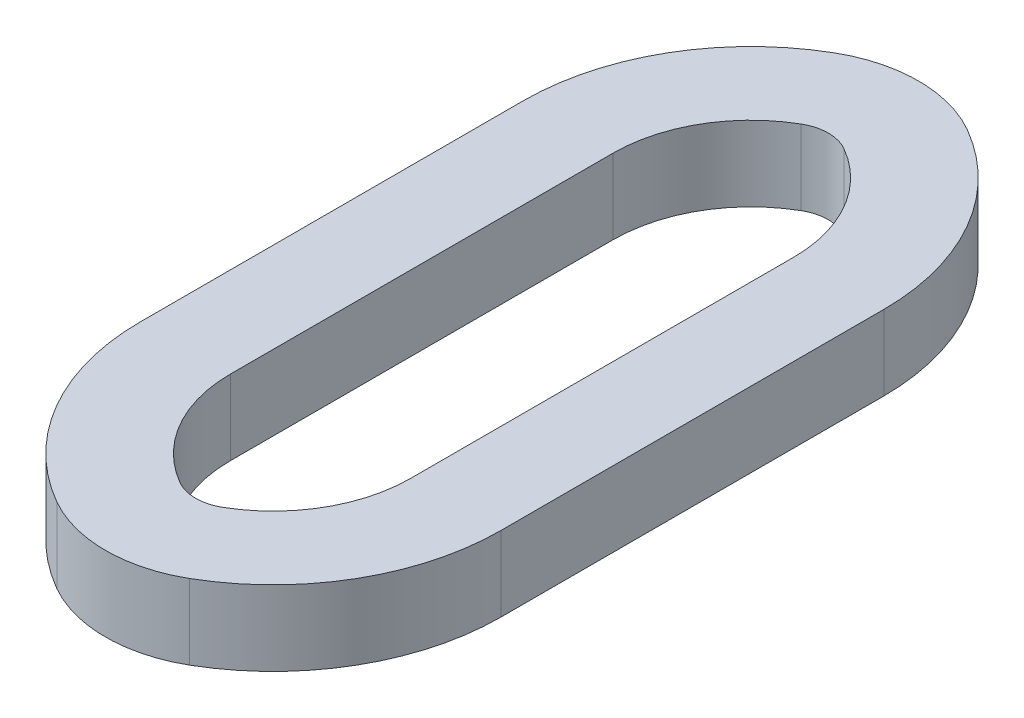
ISO-10303-21;
HEADER;
FILE_DESCRIPTION(('STEP AP214'),'2;1');
FILE_NAME('part.step','',(''),(''),'','','');
FILE_SCHEMA(('AUTOMOTIVE_DESIGN { 1 0 10303 214 1 1 1 1 }'));
ENDSEC;
DATA;
#1=APPLICATION_CONTEXT('core data for automotive mechanical design processes');
#2=APPLICATION_PROTOCOL_DEFINITION('international standard','automotive_design',2000,#1);
#3=PRODUCT_CONTEXT('',#1,'mechanical');
#4=PRODUCT('Part','Part','',(#3));
#5=PRODUCT_RELATED_PRODUCT_CATEGORY('part','',(#4));
#6=PRODUCT_DEFINITION_FORMATION('','',#4);
#7=PRODUCT_DEFINITION_CONTEXT('part definition',#1,'design');
#8=PRODUCT_DEFINITION('design','',#6,#7);
#9=PRODUCT_DEFINITION_SHAPE('','',#8);
#10=(LENGTH_UNIT() NAMED_UNIT(*) SI_UNIT(.MILLI.,.METRE.));
#11=(NAMED_UNIT(*) PLANE_ANGLE_UNIT() SI_UNIT($,.RADIAN.));
#12=(NAMED_UNIT(*) SI_UNIT($,.STERADIAN.) SOLID_ANGLE_UNIT());
#13=UNCERTAINTY_MEASURE_WITH_UNIT(LENGTH_MEASURE(1.E-05),#10,'distance_accuracy_value','');
#14=(GEOMETRIC_REPRESENTATION_CONTEXT(3) GLOBAL_UNCERTAINTY_ASSIGNED_CONTEXT((#13)) GLOBAL_UNIT_ASSIGNED_CONTEXT((#10,
#11,#12)) REPRESENTATION_CONTEXT('',''));
#15=CARTESIAN_POINT('',(0.,0.,0.));
#16=DIRECTION('',(0.,0.,1.));
#17=DIRECTION('',(1.,0.,0.));
#18=AXIS2_PLACEMENT_3D('',#15,#16,#17);
#19=CARTESIAN_POINT('',(-42.7,7.49,-4.09397459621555));
#20=DIRECTION('',(0.,1.,0.));
#21=DIRECTION('',(0.,0.,1.));
#22=AXIS2_PLACEMENT_3D('',#19,#20,#21);
#23=PLANE('',#22);
#24=CARTESIAN_POINT('',(-42.7,7.49,-4.09397459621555));
#25=DIRECTION('',(0.,1.,0.));
#26=DIRECTION('',(0.,0.,1.));
#27=AXIS2_PLACEMENT_3D('',#24,#25,#26);
#28=CIRCLE('',#27,2.40000000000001);
#29=CARTESIAN_POINT('',(-40.3,7.49,-4.09397459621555));
#30=VERTEX_POINT('',#29);
#31=CARTESIAN_POINT('',(-41.5,7.49,-6.17243556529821));
#32=VERTEX_POINT('',#31);
#33=EDGE_CURVE('E219',#30,#32,#28,.T.);
#34=ORIENTED_EDGE('',*,*,#33,.T.);
#35=CARTESIAN_POINT('',(-42.2,7.49,-4.96));
#36=DIRECTION('',(0.,1.,0.));
#37=DIRECTION('',(0.,0.,1.));
#38=AXIS2_PLACEMENT_3D('',#35,#36,#37);
#39=CIRCLE('',#38,1.4);
#40=CARTESIAN_POINT('',(-42.9,7.49,-6.17243556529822));
#41=VERTEX_POINT('',#40);
#42=EDGE_CURVE('E222',#32,#41,#39,.T.);
#43=ORIENTED_EDGE('',*,*,#42,.T.);
#44=CARTESIAN_POINT('',(-41.7,7.49,-4.09397459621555));
#45=DIRECTION('',(0.,1.,0.));
#46=DIRECTION('',(0.,0.,1.));
#47=AXIS2_PLACEMENT_3D('',#44,#45,#46);
#48=CIRCLE('',#47,2.40000000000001);
#49=CARTESIAN_POINT('',(-44.1,7.49,-4.09397459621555));
#50=VERTEX_POINT('',#49);
#51=EDGE_CURVE('E225',#41,#50,#48,.T.);
#52=ORIENTED_EDGE('',*,*,#51,.T.);
#53=DIRECTION('',(0.,0.,1.));
#54=VECTOR('',#53,1.);
#55=CARTESIAN_POINT('',(-44.1,7.49,-4.09397459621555));
#56=LINE('',#55,#54);
#57=CARTESIAN_POINT('',(-44.1,7.49,-0.0660254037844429));
#58=VERTEX_POINT('',#57);
#59=EDGE_CURVE('E227',#50,#58,#56,.T.);
#60=ORIENTED_EDGE('',*,*,#59,.T.);
#61=CARTESIAN_POINT('',(-41.7,7.49,-0.0660254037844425));
#62=DIRECTION('',(0.,1.,0.));
#63=DIRECTION('',(0.,0.,1.));
#64=AXIS2_PLACEMENT_3D('',#61,#62,#63);
#65=CIRCLE('',#64,2.40000000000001);
#66=CARTESIAN_POINT('',(-42.9,7.49,2.01243556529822));
#67=VERTEX_POINT('',#66);
#68=EDGE_CURVE('E229',#58,#67,#65,.T.);
#69=ORIENTED_EDGE('',*,*,#68,.T.);
#70=CARTESIAN_POINT('',(-42.2,7.49,0.800000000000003));
#71=DIRECTION('',(0.,1.,0.));
#72=DIRECTION('',(0.,0.,1.));
#73=AXIS2_PLACEMENT_3D('',#70,#71,#72);
#74=CIRCLE('',#73,1.4);
#75=CARTESIAN_POINT('',(-41.5,7.49,2.01243556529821));
#76=VERTEX_POINT('',#75);
#77=EDGE_CURVE('E231',#67,#76,#74,.T.);
#78=ORIENTED_EDGE('',*,*,#77,.T.);
#79=CARTESIAN_POINT('',(-42.7,7.49,-0.0660254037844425));
#80=DIRECTION('',(0.,1.,0.));
#81=DIRECTION('',(0.,0.,1.));
#82=AXIS2_PLACEMENT_3D('',#79,#80,#81);
#83=CIRCLE('',#82,2.40000000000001);
#84=CARTESIAN_POINT('',(-40.3,7.49,-0.0660254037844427));
#85=VERTEX_POINT('',#84);
#86=EDGE_CURVE('E233',#76,#85,#83,.T.);
#87=ORIENTED_EDGE('',*,*,#86,.T.);
#88=DIRECTION('',(0.,0.,-1.));
#89=VECTOR('',#88,1.);
#90=CARTESIAN_POINT('',(-40.3,7.49,-0.0660254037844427));
#91=LINE('',#90,#89);
#92=EDGE_CURVE('E235',#85,#30,#91,.T.);
#93=ORIENTED_EDGE('',*,*,#92,.T.);
#94=EDGE_LOOP('',(#34,#43,#52,#60,#69,#78,#87,#93));
#95=FACE_BOUND('',#94,.T.);
#96=CARTESIAN_POINT('',(-42.2,7.49,-4.96));
#97=DIRECTION('',(0.,1.,0.));
#98=DIRECTION('',(0.,0.,1.));
#99=AXIS2_PLACEMENT_3D('',#96,#97,#98);
#100=CIRCLE('',#99,0.449999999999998);
#101=CARTESIAN_POINT('',(-41.975,7.49,-5.34971143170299));
#102=VERTEX_POINT('',#101);
#103=CARTESIAN_POINT('',(-42.425,7.49,-5.349711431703));
#104=VERTEX_POINT('',#103);
#105=EDGE_CURVE('E162',#102,#104,#100,.T.);
#106=ORIENTED_EDGE('',*,*,#105,.F.);
#107=CARTESIAN_POINT('',(-42.7,7.49,-4.09397459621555));
#108=DIRECTION('',(0.,1.,0.));
#109=DIRECTION('',(0.,0.,1.));
#110=AXIS2_PLACEMENT_3D('',#107,#108,#109);
#111=CIRCLE('',#110,1.45000000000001);
#112=CARTESIAN_POINT('',(-41.25,7.49,-4.09397459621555));
#113=VERTEX_POINT('',#112);
#114=EDGE_CURVE('E154',#113,#102,#111,.T.);
#115=ORIENTED_EDGE('',*,*,#114,.F.);
#116=DIRECTION('',(0.,0.,-1.));
#117=VECTOR('',#116,1.);
#118=CARTESIAN_POINT('',(-41.25,7.49,-0.0660254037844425));
#119=LINE('',#118,#117);
#120=CARTESIAN_POINT('',(-41.25,7.49,-0.0660254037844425));
#121=VERTEX_POINT('',#120);
#122=EDGE_CURVE('E187',#121,#113,#119,.T.);
#123=ORIENTED_EDGE('',*,*,#122,.F.);
#124=CARTESIAN_POINT('',(-42.7,7.49,-0.0660254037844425));
#125=DIRECTION('',(0.,1.,0.));
#126=DIRECTION('',(0.,0.,1.));
#127=AXIS2_PLACEMENT_3D('',#124,#125,#126);
#128=CIRCLE('',#127,1.45000000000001);
#129=CARTESIAN_POINT('',(-41.975,7.49,1.189711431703));
#130=VERTEX_POINT('',#129);
#131=EDGE_CURVE('E185',#130,#121,#128,.T.);
#132=ORIENTED_EDGE('',*,*,#131,.F.);
#133=CARTESIAN_POINT('',(-42.2,7.49,0.800000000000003));
#134=DIRECTION('',(0.,1.,0.));
#135=DIRECTION('',(0.,0.,1.));
#136=AXIS2_PLACEMENT_3D('',#133,#134,#135);
#137=CIRCLE('',#136,0.449999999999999);
#138=CARTESIAN_POINT('',(-42.425,7.49,1.189711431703));
#139=VERTEX_POINT('',#138);
#140=EDGE_CURVE('E183',#139,#130,#137,.T.);
#141=ORIENTED_EDGE('',*,*,#140,.F.);
#142=CARTESIAN_POINT('',(-41.7,7.49,-0.0660254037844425));
#143=DIRECTION('',(0.,1.,0.));
#144=DIRECTION('',(0.,0.,1.));
#145=AXIS2_PLACEMENT_3D('',#142,#143,#144);
#146=CIRCLE('',#145,1.45000000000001);
#147=CARTESIAN_POINT('',(-43.15,7.49,-0.0660254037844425));
#148=VERTEX_POINT('',#147);
#149=EDGE_CURVE('E181',#148,#139,#146,.T.);
#150=ORIENTED_EDGE('',*,*,#149,.F.);
#151=DIRECTION('',(0.,0.,1.));
#152=VECTOR('',#151,1.);
#153=CARTESIAN_POINT('',(-43.15,7.49,-4.09397459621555));
#154=LINE('',#153,#152);
#155=CARTESIAN_POINT('',(-43.15,7.49,-4.09397459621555));
#156=VERTEX_POINT('',#155);
#157=EDGE_CURVE('E177',#156,#148,#154,.T.);
#158=ORIENTED_EDGE('',*,*,#157,.F.);
#159=CARTESIAN_POINT('',(-41.7,7.49,-4.09397459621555));
#160=DIRECTION('',(0.,1.,0.));
#161=DIRECTION('',(0.,0.,1.));
#162=AXIS2_PLACEMENT_3D('',#159,#160,#161);
#163=CIRCLE('',#162,1.45000000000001);
#164=EDGE_CURVE('E175',#104,#156,#163,.T.);
#165=ORIENTED_EDGE('',*,*,#164,.F.);
#166=EDGE_LOOP('',(#106,#115,#123,#132,#141,#150,#158,#165));
#167=FACE_BOUND('',#166,.T.);
#168=ADVANCED_FACE('F41',(#95,#167),#23,.T.);
#169=CARTESIAN_POINT('',(-42.7,6.7,-4.09397459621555));
#170=DIRECTION('',(0.,1.,0.));
#171=DIRECTION('',(0.,0.,1.));
#172=AXIS2_PLACEMENT_3D('',#169,#170,#171);
#173=PLANE('',#172);
#174=CARTESIAN_POINT('',(-42.7,6.7,-4.09397459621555));
#175=DIRECTION('',(0.,1.,0.));
#176=DIRECTION('',(0.,0.,1.));
#177=AXIS2_PLACEMENT_3D('',#174,#175,#176);
#178=CIRCLE('',#177,2.40000000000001);
#179=CARTESIAN_POINT('',(-40.3,6.7,-4.09397459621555));
#180=VERTEX_POINT('',#179);
#181=CARTESIAN_POINT('',(-41.5,6.7,-6.17243556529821));
#182=VERTEX_POINT('',#181);
#183=EDGE_CURVE('E170',#180,#182,#178,.T.);
#184=ORIENTED_EDGE('',*,*,#183,.F.);
#185=DIRECTION('',(0.,0.,-1.));
#186=VECTOR('',#185,1.);
#187=CARTESIAN_POINT('',(-40.3,6.7,-0.0660254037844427));
#188=LINE('',#187,#186);
#189=CARTESIAN_POINT('',(-40.3,6.7,-0.0660254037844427));
#190=VERTEX_POINT('',#189);
#191=EDGE_CURVE('E223',#190,#180,#188,.T.);
#192=ORIENTED_EDGE('',*,*,#191,.F.);
#193=CARTESIAN_POINT('',(-42.7,6.7,-0.0660254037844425));
#194=DIRECTION('',(0.,1.,0.));
#195=DIRECTION('',(0.,0.,1.));
#196=AXIS2_PLACEMENT_3D('',#193,#194,#195);
#197=CIRCLE('',#196,2.40000000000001);
#198=CARTESIAN_POINT('',(-41.5,6.7,2.01243556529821));
#199=VERTEX_POINT('',#198);
#200=EDGE_CURVE('E250',#199,#190,#197,.T.);
#201=ORIENTED_EDGE('',*,*,#200,.F.);
#202=CARTESIAN_POINT('',(-42.2,6.7,0.800000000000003));
#203=DIRECTION('',(0.,1.,0.));
#204=DIRECTION('',(0.,0.,1.));
#205=AXIS2_PLACEMENT_3D('',#202,#203,#204);
#206=CIRCLE('',#205,1.4);
#207=CARTESIAN_POINT('',(-42.9,6.7,2.01243556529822));
#208=VERTEX_POINT('',#207);
#209=EDGE_CURVE('E248',#208,#199,#206,.T.);
#210=ORIENTED_EDGE('',*,*,#209,.F.);
#211=CARTESIAN_POINT('',(-41.7,6.7,-0.0660254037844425));
#212=DIRECTION('',(0.,1.,0.));
#213=DIRECTION('',(0.,0.,1.));
#214=AXIS2_PLACEMENT_3D('',#211,#212,#213);
#215=CIRCLE('',#214,2.40000000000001);
#216=CARTESIAN_POINT('',(-44.1,6.7,-0.0660254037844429));
#217=VERTEX_POINT('',#216);
#218=EDGE_CURVE('E246',#217,#208,#215,.T.);
#219=ORIENTED_EDGE('',*,*,#218,.F.);
#220=DIRECTION('',(0.,0.,1.));
#221=VECTOR('',#220,1.);
#222=CARTESIAN_POINT('',(-44.1,6.7,-4.09397459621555));
#223=LINE('',#222,#221);
#224=CARTESIAN_POINT('',(-44.1,6.7,-4.09397459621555));
#225=VERTEX_POINT('',#224);
#226=EDGE_CURVE('E244',#225,#217,#223,.T.);
#227=ORIENTED_EDGE('',*,*,#226,.F.);
#228=CARTESIAN_POINT('',(-41.7,6.7,-4.09397459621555));
#229=DIRECTION('',(0.,1.,0.));
#230=DIRECTION('',(0.,0.,1.));
#231=AXIS2_PLACEMENT_3D('',#228,#229,#230);
#232=CIRCLE('',#231,2.40000000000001);
#233=CARTESIAN_POINT('',(-42.9,6.7,-6.17243556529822));
#234=VERTEX_POINT('',#233);
#235=EDGE_CURVE('E242',#234,#225,#232,.T.);
#236=ORIENTED_EDGE('',*,*,#235,.F.);
#237=CARTESIAN_POINT('',(-42.2,6.7,-4.96));
#238=DIRECTION('',(0.,1.,0.));
#239=DIRECTION('',(0.,0.,1.));
#240=AXIS2_PLACEMENT_3D('',#237,#238,#239);
#241=CIRCLE('',#240,1.4);
#242=EDGE_CURVE('E240',#182,#234,#241,.T.);
#243=ORIENTED_EDGE('',*,*,#242,.F.);
#244=EDGE_LOOP('',(#184,#192,#201,#210,#219,#227,#236,#243));
#245=FACE_BOUND('',#244,.T.);
#246=CARTESIAN_POINT('',(-42.7,6.7,-4.09397459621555));
#247=DIRECTION('',(0.,1.,0.));
#248=DIRECTION('',(0.,0.,1.));
#249=AXIS2_PLACEMENT_3D('',#246,#247,#248);
#250=CIRCLE('',#249,1.45000000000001);
#251=CARTESIAN_POINT('',(-41.25,6.7,-4.09397459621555));
#252=VERTEX_POINT('',#251);
#253=CARTESIAN_POINT('',(-41.975,6.7,-5.34971143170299));
#254=VERTEX_POINT('',#253);
#255=EDGE_CURVE('E64',#252,#254,#250,.T.);
#256=ORIENTED_EDGE('',*,*,#255,.T.);
#257=CARTESIAN_POINT('',(-42.2,6.7,-4.96));
#258=DIRECTION('',(0.,1.,0.));
#259=DIRECTION('',(0.,0.,1.));
#260=AXIS2_PLACEMENT_3D('',#257,#258,#259);
#261=CIRCLE('',#260,0.449999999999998);
#262=CARTESIAN_POINT('',(-42.425,6.7,-5.349711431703));
#263=VERTEX_POINT('',#262);
#264=EDGE_CURVE('E169',#254,#263,#261,.T.);
#265=ORIENTED_EDGE('',*,*,#264,.T.);
#266=CARTESIAN_POINT('',(-41.7,6.7,-4.09397459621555));
#267=DIRECTION('',(0.,1.,0.));
#268=DIRECTION('',(0.,0.,1.));
#269=AXIS2_PLACEMENT_3D('',#266,#267,#268);
#270=CIRCLE('',#269,1.45000000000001);
#271=CARTESIAN_POINT('',(-43.15,6.7,-4.09397459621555));
#272=VERTEX_POINT('',#271);
#273=EDGE_CURVE('E191',#263,#272,#270,.T.);
#274=ORIENTED_EDGE('',*,*,#273,.T.);
#275=DIRECTION('',(0.,0.,1.));
#276=VECTOR('',#275,1.);
#277=CARTESIAN_POINT('',(-43.15,6.7,-4.09397459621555));
#278=LINE('',#277,#276);
#279=CARTESIAN_POINT('',(-43.15,6.7,-0.0660254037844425));
#280=VERTEX_POINT('',#279);
#281=EDGE_CURVE('E194',#272,#280,#278,.T.);
#282=ORIENTED_EDGE('',*,*,#281,.T.);
#283=CARTESIAN_POINT('',(-41.7,6.7,-0.0660254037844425));
#284=DIRECTION('',(0.,1.,0.));
#285=DIRECTION('',(0.,0.,1.));
#286=AXIS2_PLACEMENT_3D('',#283,#284,#285);
#287=CIRCLE('',#286,1.45000000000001);
#288=CARTESIAN_POINT('',(-42.425,6.7,1.189711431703));
#289=VERTEX_POINT('',#288);
#290=EDGE_CURVE('E197',#280,#289,#287,.T.);
#291=ORIENTED_EDGE('',*,*,#290,.T.);
#292=CARTESIAN_POINT('',(-42.2,6.7,0.800000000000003));
#293=DIRECTION('',(0.,1.,0.));
#294=DIRECTION('',(0.,0.,1.));
#295=AXIS2_PLACEMENT_3D('',#292,#293,#294);
#296=CIRCLE('',#295,0.449999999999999);
#297=CARTESIAN_POINT('',(-41.975,6.7,1.189711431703));
#298=VERTEX_POINT('',#297);
#299=EDGE_CURVE('E200',#289,#298,#296,.T.);
#300=ORIENTED_EDGE('',*,*,#299,.T.);
#301=CARTESIAN_POINT('',(-42.7,6.7,-0.0660254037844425));
#302=DIRECTION('',(0.,1.,0.));
#303=DIRECTION('',(0.,0.,1.));
#304=AXIS2_PLACEMENT_3D('',#301,#302,#303);
#305=CIRCLE('',#304,1.45000000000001);
#306=CARTESIAN_POINT('',(-41.25,6.7,-0.0660254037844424));
#307=VERTEX_POINT('',#306);
#308=EDGE_CURVE('E203',#298,#307,#305,.T.);
#309=ORIENTED_EDGE('',*,*,#308,.T.);
#310=DIRECTION('',(0.,0.,-1.));
#311=VECTOR('',#310,1.);
#312=CARTESIAN_POINT('',(-41.25,6.7,-0.0660254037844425));
#313=LINE('',#312,#311);
#314=EDGE_CURVE('E163',#307,#252,#313,.T.);
#315=ORIENTED_EDGE('',*,*,#314,.T.);
#316=EDGE_LOOP('',(#256,#265,#274,#282,#291,#300,#309,#315));
#317=FACE_BOUND('',#316,.T.);
#318=ADVANCED_FACE('F280',(#245,#317),#173,.F.);
#319=CARTESIAN_POINT('',(-42.7,7.49,-4.09397459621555));
#320=DIRECTION('',(0.,-1.,0.));
#321=DIRECTION('',(0.,0.,-1.));
#322=AXIS2_PLACEMENT_3D('',#319,#320,#321);
#323=CYLINDRICAL_SURFACE('',#322,2.40000000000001);
#324=ORIENTED_EDGE('',*,*,#183,.T.);
#325=DIRECTION('',(0.,-1.,0.));
#326=VECTOR('',#325,1.);
#327=CARTESIAN_POINT('',(-41.5,7.49,-6.17243556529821));
#328=LINE('',#327,#326);
#329=EDGE_CURVE('E11',#32,#182,#328,.T.);
#330=ORIENTED_EDGE('',*,*,#329,.F.);
#331=ORIENTED_EDGE('',*,*,#33,.F.);
#332=DIRECTION('',(0.,-1.,0.));
#333=VECTOR('',#332,1.);
#334=CARTESIAN_POINT('',(-40.3,7.49,-4.09397459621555));
#335=LINE('',#334,#333);
#336=EDGE_CURVE('E237',#30,#180,#335,.T.);
#337=ORIENTED_EDGE('',*,*,#336,.T.);
#338=EDGE_LOOP('',(#324,#330,#331,#337));
#339=FACE_BOUND('',#338,.T.);
#340=ADVANCED_FACE('F43',(#339),#323,.T.);
#341=CARTESIAN_POINT('',(-42.2,7.49,-4.96));
#342=DIRECTION('',(0.,-1.,0.));
#343=DIRECTION('',(0.,0.,-1.));
#344=AXIS2_PLACEMENT_3D('',#341,#342,#343);
#345=CYLINDRICAL_SURFACE('',#344,1.4);
#346=ORIENTED_EDGE('',*,*,#242,.T.);
#347=DIRECTION('',(0.,-1.,0.));
#348=VECTOR('',#347,1.);
#349=CARTESIAN_POINT('',(-42.9,7.49,-6.17243556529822));
#350=LINE('',#349,#348);
#351=EDGE_CURVE('E49',#41,#234,#350,.T.);
#352=ORIENTED_EDGE('',*,*,#351,.F.);
#353=ORIENTED_EDGE('',*,*,#42,.F.);
#354=ORIENTED_EDGE('',*,*,#329,.T.);
#355=EDGE_LOOP('',(#346,#352,#353,#354));
#356=FACE_BOUND('',#355,.T.);
#357=ADVANCED_FACE('F297',(#356),#345,.T.);
#358=CARTESIAN_POINT('',(-41.7,7.49,-4.09397459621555));
#359=DIRECTION('',(0.,-1.,0.));
#360=DIRECTION('',(0.,0.,-1.));
#361=AXIS2_PLACEMENT_3D('',#358,#359,#360);
#362=CYLINDRICAL_SURFACE('',#361,2.40000000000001);
#363=ORIENTED_EDGE('',*,*,#235,.T.);
#364=DIRECTION('',(0.,-1.,0.));
#365=VECTOR('',#364,1.);
#366=CARTESIAN_POINT('',(-44.1,7.49,-4.09397459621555));
#367=LINE('',#366,#365);
#368=EDGE_CURVE('E267',#50,#225,#367,.T.);
#369=ORIENTED_EDGE('',*,*,#368,.F.);
#370=ORIENTED_EDGE('',*,*,#51,.F.);
#371=ORIENTED_EDGE('',*,*,#351,.T.);
#372=EDGE_LOOP('',(#363,#369,#370,#371));
#373=FACE_BOUND('',#372,.T.);
#374=ADVANCED_FACE('F274',(#373),#362,.T.);
#375=CARTESIAN_POINT('',(-44.1,7.49,-4.09397459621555));
#376=DIRECTION('',(1.,0.,0.));
#377=DIRECTION('',(0.,0.,-1.));
#378=AXIS2_PLACEMENT_3D('',#375,#376,#377);
#379=PLANE('',#378);
#380=ORIENTED_EDGE('',*,*,#226,.T.);
#381=DIRECTION('',(0.,-1.,0.));
#382=VECTOR('',#381,1.);
#383=CARTESIAN_POINT('',(-44.1,7.49,-0.0660254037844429));
#384=LINE('',#383,#382);
#385=EDGE_CURVE('E264',#58,#217,#384,.T.);
#386=ORIENTED_EDGE('',*,*,#385,.F.);
#387=ORIENTED_EDGE('',*,*,#59,.F.);
#388=ORIENTED_EDGE('',*,*,#368,.T.);
#389=EDGE_LOOP('',(#380,#386,#387,#388));
#390=FACE_BOUND('',#389,.T.);
#391=ADVANCED_FACE('F286',(#390),#379,.F.);
#392=CARTESIAN_POINT('',(-41.7,7.49,-0.0660254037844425));
#393=DIRECTION('',(0.,-1.,0.));
#394=DIRECTION('',(0.,0.,-1.));
#395=AXIS2_PLACEMENT_3D('',#392,#393,#394);
#396=CYLINDRICAL_SURFACE('',#395,2.40000000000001);
#397=ORIENTED_EDGE('',*,*,#218,.T.);
#398=DIRECTION('',(0.,-1.,0.));
#399=VECTOR('',#398,1.);
#400=CARTESIAN_POINT('',(-42.9,7.49,2.01243556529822));
#401=LINE('',#400,#399);
#402=EDGE_CURVE('E261',#67,#208,#401,.T.);
#403=ORIENTED_EDGE('',*,*,#402,.F.);
#404=ORIENTED_EDGE('',*,*,#68,.F.);
#405=ORIENTED_EDGE('',*,*,#385,.T.);
#406=EDGE_LOOP('',(#397,#403,#404,#405));
#407=FACE_BOUND('',#406,.T.);
#408=ADVANCED_FACE('F290',(#407),#396,.T.);
#409=CARTESIAN_POINT('',(-42.2,7.49,0.800000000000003));
#410=DIRECTION('',(0.,-1.,0.));
#411=DIRECTION('',(0.,0.,-1.));
#412=AXIS2_PLACEMENT_3D('',#409,#410,#411);
#413=CYLINDRICAL_SURFACE('',#412,1.4);
#414=ORIENTED_EDGE('',*,*,#209,.T.);
#415=DIRECTION('',(0.,-1.,0.));
#416=VECTOR('',#415,1.);
#417=CARTESIAN_POINT('',(-41.5,7.49,2.01243556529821));
#418=LINE('',#417,#416);
#419=EDGE_CURVE('E258',#76,#199,#418,.T.);
#420=ORIENTED_EDGE('',*,*,#419,.F.);
#421=ORIENTED_EDGE('',*,*,#77,.F.);
#422=ORIENTED_EDGE('',*,*,#402,.T.);
#423=EDGE_LOOP('',(#414,#420,#421,#422));
#424=FACE_BOUND('',#423,.T.);
#425=ADVANCED_FACE('F310',(#424),#413,.T.);
#426=CARTESIAN_POINT('',(-42.7,7.49,-0.0660254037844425));
#427=DIRECTION('',(0.,-1.,0.));
#428=DIRECTION('',(0.,0.,-1.));
#429=AXIS2_PLACEMENT_3D('',#426,#427,#428);
#430=CYLINDRICAL_SURFACE('',#429,2.40000000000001);
#431=ORIENTED_EDGE('',*,*,#200,.T.);
#432=DIRECTION('',(0.,-1.,0.));
#433=VECTOR('',#432,1.);
#434=CARTESIAN_POINT('',(-40.3,7.49,-0.0660254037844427));
#435=LINE('',#434,#433);
#436=EDGE_CURVE('E255',#85,#190,#435,.T.);
#437=ORIENTED_EDGE('',*,*,#436,.F.);
#438=ORIENTED_EDGE('',*,*,#86,.F.);
#439=ORIENTED_EDGE('',*,*,#419,.T.);
#440=EDGE_LOOP('',(#431,#437,#438,#439));
#441=FACE_BOUND('',#440,.T.);
#442=ADVANCED_FACE('F308',(#441),#430,.T.);
#443=CARTESIAN_POINT('',(-40.3,7.49,-0.0660254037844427));
#444=DIRECTION('',(-1.,0.,0.));
#445=DIRECTION('',(0.,0.,1.));
#446=AXIS2_PLACEMENT_3D('',#443,#444,#445);
#447=PLANE('',#446);
#448=ORIENTED_EDGE('',*,*,#191,.T.);
#449=ORIENTED_EDGE('',*,*,#336,.F.);
#450=ORIENTED_EDGE('',*,*,#92,.F.);
#451=ORIENTED_EDGE('',*,*,#436,.T.);
#452=EDGE_LOOP('',(#448,#449,#450,#451));
#453=FACE_BOUND('',#452,.T.);
#454=ADVANCED_FACE('F303',(#453),#447,.F.);
#455=CARTESIAN_POINT('',(-42.7,7.49,-4.09397459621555));
#456=DIRECTION('',(0.,-1.,0.));
#457=DIRECTION('',(0.,0.,-1.));
#458=AXIS2_PLACEMENT_3D('',#455,#456,#457);
#459=CYLINDRICAL_SURFACE('',#458,1.45000000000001);
#460=ORIENTED_EDGE('',*,*,#255,.F.);
#461=DIRECTION('',(0.,-1.,0.));
#462=VECTOR('',#461,1.);
#463=CARTESIAN_POINT('',(-41.25,7.49,-4.09397459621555));
#464=LINE('',#463,#462);
#465=EDGE_CURVE('E158',#113,#252,#464,.T.);
#466=ORIENTED_EDGE('',*,*,#465,.F.);
#467=ORIENTED_EDGE('',*,*,#114,.T.);
#468=DIRECTION('',(0.,-1.,0.));
#469=VECTOR('',#468,1.);
#470=CARTESIAN_POINT('',(-41.975,7.49,-5.34971143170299));
#471=LINE('',#470,#469);
#472=EDGE_CURVE('E157',#102,#254,#471,.T.);
#473=ORIENTED_EDGE('',*,*,#472,.T.);
#474=EDGE_LOOP('',(#460,#466,#467,#473));
#475=FACE_BOUND('',#474,.T.);
#476=ADVANCED_FACE('F156',(#475),#459,.F.);
#477=CARTESIAN_POINT('',(-42.2,7.49,-4.96));
#478=DIRECTION('',(0.,-1.,0.));
#479=DIRECTION('',(0.,0.,-1.));
#480=AXIS2_PLACEMENT_3D('',#477,#478,#479);
#481=CYLINDRICAL_SURFACE('',#480,0.449999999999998);
#482=ORIENTED_EDGE('',*,*,#264,.F.);
#483=ORIENTED_EDGE('',*,*,#472,.F.);
#484=ORIENTED_EDGE('',*,*,#105,.T.);
#485=DIRECTION('',(0.,-1.,0.));
#486=VECTOR('',#485,1.);
#487=CARTESIAN_POINT('',(-42.425,7.49,-5.349711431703));
#488=LINE('',#487,#486);
#489=EDGE_CURVE('E171',#104,#263,#488,.T.);
#490=ORIENTED_EDGE('',*,*,#489,.T.);
#491=EDGE_LOOP('',(#482,#483,#484,#490));
#492=FACE_BOUND('',#491,.T.);
#493=ADVANCED_FACE('F166',(#492),#481,.F.);
#494=CARTESIAN_POINT('',(-41.7,7.49,-4.09397459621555));
#495=DIRECTION('',(0.,-1.,0.));
#496=DIRECTION('',(0.,0.,-1.));
#497=AXIS2_PLACEMENT_3D('',#494,#495,#496);
#498=CYLINDRICAL_SURFACE('',#497,1.45000000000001);
#499=ORIENTED_EDGE('',*,*,#273,.F.);
#500=ORIENTED_EDGE('',*,*,#489,.F.);
#501=ORIENTED_EDGE('',*,*,#164,.T.);
#502=DIRECTION('',(0.,-1.,0.));
#503=VECTOR('',#502,1.);
#504=CARTESIAN_POINT('',(-43.15,7.49,-4.09397459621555));
#505=LINE('',#504,#503);
#506=EDGE_CURVE('E216',#156,#272,#505,.T.);
#507=ORIENTED_EDGE('',*,*,#506,.T.);
#508=EDGE_LOOP('',(#499,#500,#501,#507));
#509=FACE_BOUND('',#508,.T.);
#510=ADVANCED_FACE('F335',(#509),#498,.F.);
#511=CARTESIAN_POINT('',(-43.15,7.49,-4.09397459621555));
#512=DIRECTION('',(1.,0.,0.));
#513=DIRECTION('',(0.,0.,-1.));
#514=AXIS2_PLACEMENT_3D('',#511,#512,#513);
#515=PLANE('',#514);
#516=ORIENTED_EDGE('',*,*,#281,.F.);
#517=ORIENTED_EDGE('',*,*,#506,.F.);
#518=ORIENTED_EDGE('',*,*,#157,.T.);
#519=DIRECTION('',(0.,-1.,0.));
#520=VECTOR('',#519,1.);
#521=CARTESIAN_POINT('',(-43.15,7.49,-0.0660254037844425));
#522=LINE('',#521,#520);
#523=EDGE_CURVE('E214',#148,#280,#522,.T.);
#524=ORIENTED_EDGE('',*,*,#523,.T.);
#525=EDGE_LOOP('',(#516,#517,#518,#524));
#526=FACE_BOUND('',#525,.T.);
#527=ADVANCED_FACE('F339',(#526),#515,.T.);
#528=CARTESIAN_POINT('',(-41.7,7.49,-0.0660254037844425));
#529=DIRECTION('',(0.,-1.,0.));
#530=DIRECTION('',(0.,0.,-1.));
#531=AXIS2_PLACEMENT_3D('',#528,#529,#530);
#532=CYLINDRICAL_SURFACE('',#531,1.45000000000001);
#533=ORIENTED_EDGE('',*,*,#290,.F.);
#534=ORIENTED_EDGE('',*,*,#523,.F.);
#535=ORIENTED_EDGE('',*,*,#149,.T.);
#536=DIRECTION('',(0.,-1.,0.));
#537=VECTOR('',#536,1.);
#538=CARTESIAN_POINT('',(-42.425,7.49,1.189711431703));
#539=LINE('',#538,#537);
#540=EDGE_CURVE('E212',#139,#289,#539,.T.);
#541=ORIENTED_EDGE('',*,*,#540,.T.);
#542=EDGE_LOOP('',(#533,#534,#535,#541));
#543=FACE_BOUND('',#542,.T.);
#544=ADVANCED_FACE('F345',(#543),#532,.F.);
#545=CARTESIAN_POINT('',(-42.2,7.49,0.800000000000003));
#546=DIRECTION('',(0.,-1.,0.));
#547=DIRECTION('',(0.,0.,-1.));
#548=AXIS2_PLACEMENT_3D('',#545,#546,#547);
#549=CYLINDRICAL_SURFACE('',#548,0.449999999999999);
#550=ORIENTED_EDGE('',*,*,#299,.F.);
#551=ORIENTED_EDGE('',*,*,#540,.F.);
#552=ORIENTED_EDGE('',*,*,#140,.T.);
#553=DIRECTION('',(0.,-1.,0.));
#554=VECTOR('',#553,1.);
#555=CARTESIAN_POINT('',(-41.975,7.49,1.189711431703));
#556=LINE('',#555,#554);
#557=EDGE_CURVE('E210',#130,#298,#556,.T.);
#558=ORIENTED_EDGE('',*,*,#557,.T.);
#559=EDGE_LOOP('',(#550,#551,#552,#558));
#560=FACE_BOUND('',#559,.T.);
#561=ADVANCED_FACE('F349',(#560),#549,.F.);
#562=CARTESIAN_POINT('',(-42.7,7.49,-0.0660254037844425));
#563=DIRECTION('',(0.,-1.,0.));
#564=DIRECTION('',(0.,0.,-1.));
#565=AXIS2_PLACEMENT_3D('',#562,#563,#564);
#566=CYLINDRICAL_SURFACE('',#565,1.45000000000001);
#567=ORIENTED_EDGE('',*,*,#308,.F.);
#568=ORIENTED_EDGE('',*,*,#557,.F.);
#569=ORIENTED_EDGE('',*,*,#131,.T.);
#570=DIRECTION('',(0.,-1.,0.));
#571=VECTOR('',#570,1.);
#572=CARTESIAN_POINT('',(-41.25,7.49,-0.0660254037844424));
#573=LINE('',#572,#571);
#574=EDGE_CURVE('E56',#121,#307,#573,.T.);
#575=ORIENTED_EDGE('',*,*,#574,.T.);
#576=EDGE_LOOP('',(#567,#568,#569,#575));
#577=FACE_BOUND('',#576,.T.);
#578=ADVANCED_FACE('F353',(#577),#566,.F.);
#579=CARTESIAN_POINT('',(-41.25,7.49,-0.0660254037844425));
#580=DIRECTION('',(-1.,0.,0.));
#581=DIRECTION('',(0.,0.,1.));
#582=AXIS2_PLACEMENT_3D('',#579,#580,#581);
#583=PLANE('',#582);
#584=ORIENTED_EDGE('',*,*,#314,.F.);
#585=ORIENTED_EDGE('',*,*,#574,.F.);
#586=ORIENTED_EDGE('',*,*,#122,.T.);
#587=ORIENTED_EDGE('',*,*,#465,.T.);
#588=EDGE_LOOP('',(#584,#585,#586,#587));
#589=FACE_BOUND('',#588,.T.);
#590=ADVANCED_FACE('F357',(#589),#583,.T.);
#591=CLOSED_SHELL('',(#168,#318,#340,#357,#374,#391,#408,#425,#442,#454,#476,#493,#510,#527,
#544,#561,#578,#590));
#592=MANIFOLD_SOLID_BREP('B2',#591);
#593=ADVANCED_BREP_SHAPE_REPRESENTATION('',(#18,#592),#14);
#594=SHAPE_DEFINITION_REPRESENTATION(#9,#593);
ENDSEC;
END-ISO-10303-21;
